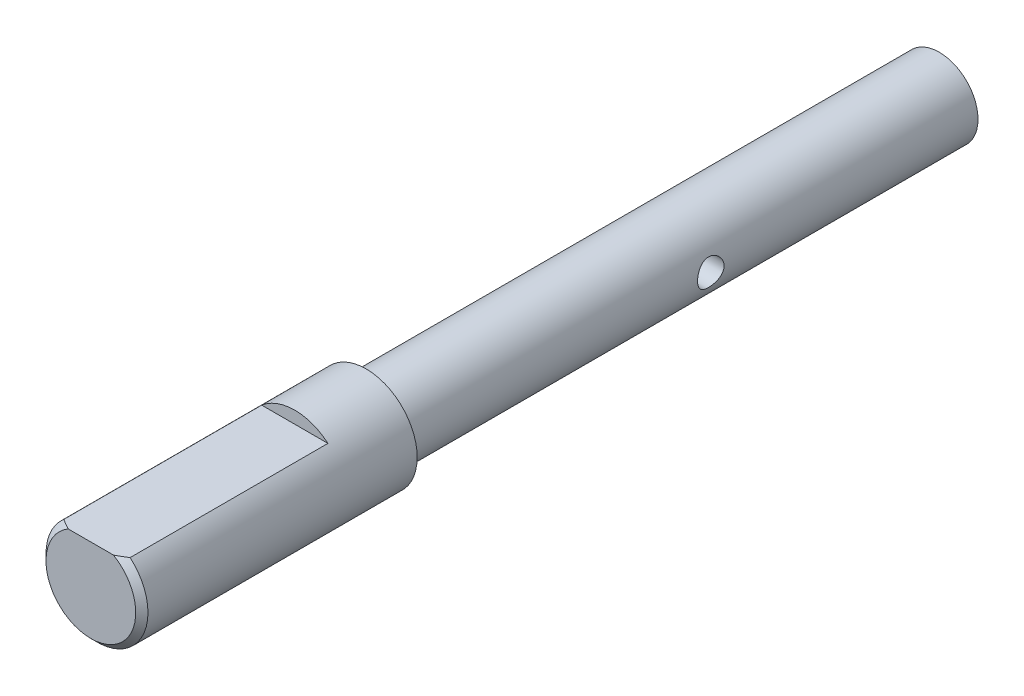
from build123d import *

# Parameters (mm, degrees)
SKETCH1_R               = 4.826
BOSS_EXTRUDE1_DEPTH     = 71.374
SKETCH2_R               = 6.35
BOSS_EXTRUDE2_DEPTH     = 34.29
CHAMFER1_SIZE           = 0.762
SKETCH3_W               = 17.276669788
SKETCH3_H               = 1.524
CUT_EXTRUDE1_DEPTH      = 25.4
CUT_EXTRUDE2_DEPTH      = 107.044923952
CUT_EXTRUDE2_DEPTH_BACK = 107.044923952
SKETCH5_R               = 1.651


with BuildPart() as part:
    # Sketch1 → Boss-Extrude1 (new body)
    with BuildSketch(Plane.XY):
        Circle(SKETCH1_R)
    extrude(amount=BOSS_EXTRUDE1_DEPTH)

    # Sketch2 → Boss-Extrude2 (add)
    with BuildSketch(Plane.XY.offset(71.374)):
        Circle(SKETCH2_R)
    extrude(amount=BOSS_EXTRUDE2_DEPTH)

    # Chamfer1
    chamfer1_edges = [part.edges().sort_by_distance(p)[0] for p in [
        (-6.35, 0, 105.664),
    ]]
    chamfer(chamfer1_edges, length=CHAMFER1_SIZE)

    # Sketch3 → Cut-Extrude1 (cut)
    with BuildSketch(Plane.XY.offset(105.664)):
        with Locations((-0.399922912, 5.588)):
            Rectangle(SKETCH3_W, SKETCH3_H)
    extrude(amount=-CUT_EXTRUDE1_DEPTH, mode=Mode.SUBTRACT)

    # Sketch5 → Cut-Extrude2 (cut, two sides: drawn at the far end of the back side and taken through both)
    with BuildSketch(Plane(origin=(0, 0, 0), x_dir=(0, 0, -1), z_dir=(1, 0, 0)).offset(-CUT_EXTRUDE2_DEPTH_BACK)):
        with Locations(Location((-33.274, 0, 0), (0, 0, 180))):
            Circle(SKETCH5_R)
    extrude(amount=CUT_EXTRUDE2_DEPTH + CUT_EXTRUDE2_DEPTH_BACK, mode=Mode.SUBTRACT)


solid = part.part
